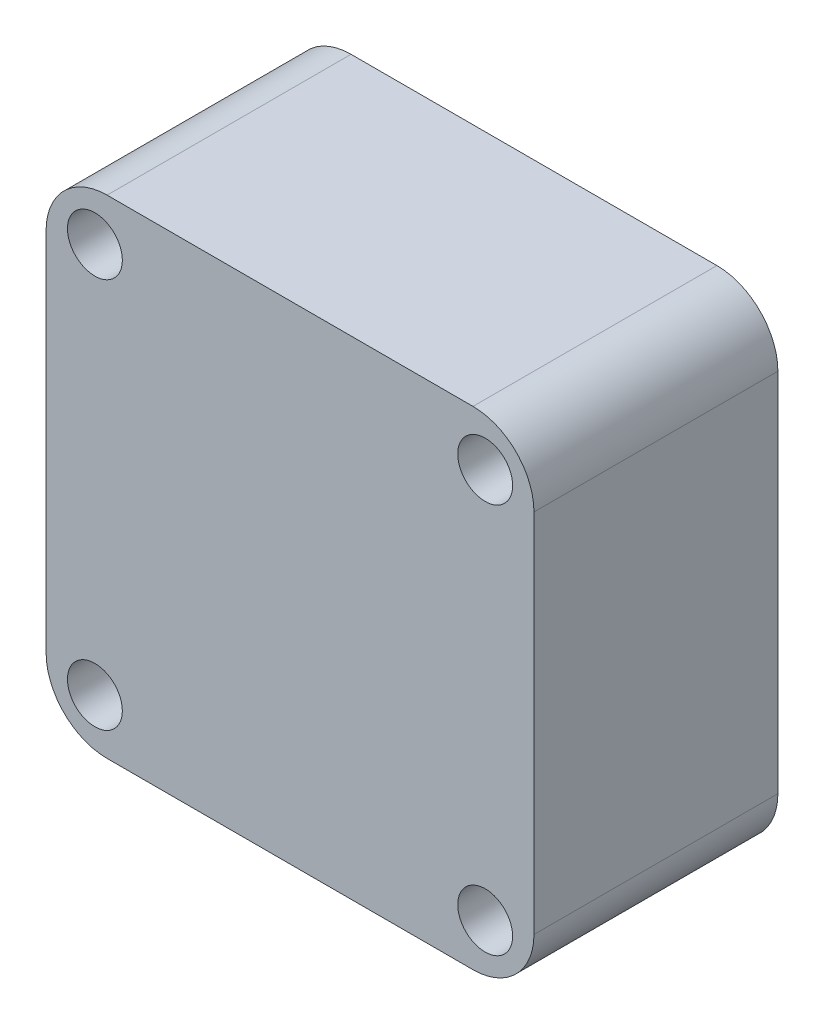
ISO-10303-21;
HEADER;
FILE_DESCRIPTION(('STEP AP214'),'2;1');
FILE_NAME('part.step','',(''),(''),'','','');
FILE_SCHEMA(('AUTOMOTIVE_DESIGN { 1 0 10303 214 1 1 1 1 }'));
ENDSEC;
DATA;
#1=APPLICATION_CONTEXT('core data for automotive mechanical design processes');
#2=APPLICATION_PROTOCOL_DEFINITION('international standard','automotive_design',2000,#1);
#3=PRODUCT_CONTEXT('',#1,'mechanical');
#4=PRODUCT('Part','Part','',(#3));
#5=PRODUCT_RELATED_PRODUCT_CATEGORY('part','',(#4));
#6=PRODUCT_DEFINITION_FORMATION('','',#4);
#7=PRODUCT_DEFINITION_CONTEXT('part definition',#1,'design');
#8=PRODUCT_DEFINITION('design','',#6,#7);
#9=PRODUCT_DEFINITION_SHAPE('','',#8);
#10=(LENGTH_UNIT() NAMED_UNIT(*) SI_UNIT(.MILLI.,.METRE.));
#11=(NAMED_UNIT(*) PLANE_ANGLE_UNIT() SI_UNIT($,.RADIAN.));
#12=(NAMED_UNIT(*) SI_UNIT($,.STERADIAN.) SOLID_ANGLE_UNIT());
#13=UNCERTAINTY_MEASURE_WITH_UNIT(LENGTH_MEASURE(1.E-05),#10,'distance_accuracy_value','');
#14=(GEOMETRIC_REPRESENTATION_CONTEXT(3) GLOBAL_UNCERTAINTY_ASSIGNED_CONTEXT((#13)) GLOBAL_UNIT_ASSIGNED_CONTEXT((#10,
#11,#12)) REPRESENTATION_CONTEXT('',''));
#15=CARTESIAN_POINT('',(0.,0.,0.));
#16=DIRECTION('',(0.,0.,1.));
#17=DIRECTION('',(1.,0.,0.));
#18=AXIS2_PLACEMENT_3D('',#15,#16,#17);
#19=CARTESIAN_POINT('',(0.,0.,20.));
#20=DIRECTION('',(0.,0.,1.));
#21=DIRECTION('',(1.,0.,0.));
#22=AXIS2_PLACEMENT_3D('',#19,#20,#21);
#23=PLANE('',#22);
#24=CARTESIAN_POINT('',(16.,-16.,20.));
#25=DIRECTION('',(0.,0.,1.));
#26=DIRECTION('',(1.,0.,0.));
#27=AXIS2_PLACEMENT_3D('',#24,#25,#26);
#28=CIRCLE('',#27,2.25);
#29=CARTESIAN_POINT('',(18.25,-16.,20.));
#30=VERTEX_POINT('',#29);
#31=EDGE_CURVE('E180',#30,#30,#28,.T.);
#32=ORIENTED_EDGE('',*,*,#31,.F.);
#33=EDGE_LOOP('',(#32));
#34=FACE_BOUND('',#33,.T.);
#35=CARTESIAN_POINT('',(-16.,16.,20.));
#36=DIRECTION('',(0.,0.,1.));
#37=DIRECTION('',(1.,0.,0.));
#38=AXIS2_PLACEMENT_3D('',#35,#36,#37);
#39=CIRCLE('',#38,2.25);
#40=CARTESIAN_POINT('',(-13.75,16.,20.));
#41=VERTEX_POINT('',#40);
#42=EDGE_CURVE('E164',#41,#41,#39,.T.);
#43=ORIENTED_EDGE('',*,*,#42,.F.);
#44=EDGE_LOOP('',(#43));
#45=FACE_BOUND('',#44,.T.);
#46=DIRECTION('',(0.,-1.,0.));
#47=VECTOR('',#46,1.);
#48=CARTESIAN_POINT('',(-20.,20.,20.));
#49=LINE('',#48,#47);
#50=CARTESIAN_POINT('',(-20.,15.,20.));
#51=VERTEX_POINT('',#50);
#52=CARTESIAN_POINT('',(-20.,-15.,20.));
#53=VERTEX_POINT('',#52);
#54=EDGE_CURVE('E122',#51,#53,#49,.T.);
#55=ORIENTED_EDGE('',*,*,#54,.T.);
#56=CARTESIAN_POINT('',(-15.,-15.,20.));
#57=DIRECTION('',(0.,0.,1.));
#58=DIRECTION('',(1.,0.,0.));
#59=AXIS2_PLACEMENT_3D('',#56,#57,#58);
#60=CIRCLE('',#59,5.);
#61=CARTESIAN_POINT('',(-15.,-20.,20.));
#62=VERTEX_POINT('',#61);
#63=EDGE_CURVE('E157',#53,#62,#60,.T.);
#64=ORIENTED_EDGE('',*,*,#63,.T.);
#65=DIRECTION('',(1.,0.,0.));
#66=VECTOR('',#65,1.);
#67=CARTESIAN_POINT('',(-20.,-20.,20.));
#68=LINE('',#67,#66);
#69=CARTESIAN_POINT('',(15.,-20.,20.));
#70=VERTEX_POINT('',#69);
#71=EDGE_CURVE('E123',#62,#70,#68,.T.);
#72=ORIENTED_EDGE('',*,*,#71,.T.);
#73=CARTESIAN_POINT('',(15.,-15.,20.));
#74=DIRECTION('',(0.,0.,1.));
#75=DIRECTION('',(1.,0.,0.));
#76=AXIS2_PLACEMENT_3D('',#73,#74,#75);
#77=CIRCLE('',#76,5.);
#78=CARTESIAN_POINT('',(20.,-15.,20.));
#79=VERTEX_POINT('',#78);
#80=EDGE_CURVE('E58',#70,#79,#77,.T.);
#81=ORIENTED_EDGE('',*,*,#80,.T.);
#82=DIRECTION('',(0.,1.,0.));
#83=VECTOR('',#82,1.);
#84=CARTESIAN_POINT('',(20.,20.,20.));
#85=LINE('',#84,#83);
#86=CARTESIAN_POINT('',(20.,15.,20.));
#87=VERTEX_POINT('',#86);
#88=EDGE_CURVE('E133',#79,#87,#85,.T.);
#89=ORIENTED_EDGE('',*,*,#88,.T.);
#90=CARTESIAN_POINT('',(15.,15.,20.));
#91=DIRECTION('',(0.,0.,1.));
#92=DIRECTION('',(1.,0.,0.));
#93=AXIS2_PLACEMENT_3D('',#90,#91,#92);
#94=CIRCLE('',#93,5.);
#95=CARTESIAN_POINT('',(15.,20.,20.));
#96=VERTEX_POINT('',#95);
#97=EDGE_CURVE('E154',#87,#96,#94,.T.);
#98=ORIENTED_EDGE('',*,*,#97,.T.);
#99=DIRECTION('',(-1.,0.,0.));
#100=VECTOR('',#99,1.);
#101=CARTESIAN_POINT('',(-20.,20.,20.));
#102=LINE('',#101,#100);
#103=CARTESIAN_POINT('',(-15.,20.,20.));
#104=VERTEX_POINT('',#103);
#105=EDGE_CURVE('E171',#96,#104,#102,.T.);
#106=ORIENTED_EDGE('',*,*,#105,.T.);
#107=CARTESIAN_POINT('',(-15.,15.,20.));
#108=DIRECTION('',(0.,0.,1.));
#109=DIRECTION('',(1.,0.,0.));
#110=AXIS2_PLACEMENT_3D('',#107,#108,#109);
#111=CIRCLE('',#110,5.);
#112=EDGE_CURVE('E140',#104,#51,#111,.T.);
#113=ORIENTED_EDGE('',*,*,#112,.T.);
#114=EDGE_LOOP('',(#55,#64,#72,#81,#89,#98,#106,#113));
#115=FACE_BOUND('',#114,.T.);
#116=CARTESIAN_POINT('',(16.,16.,20.));
#117=DIRECTION('',(0.,0.,1.));
#118=DIRECTION('',(1.,0.,0.));
#119=AXIS2_PLACEMENT_3D('',#116,#117,#118);
#120=CIRCLE('',#119,2.25);
#121=CARTESIAN_POINT('',(18.25,16.,20.));
#122=VERTEX_POINT('',#121);
#123=EDGE_CURVE('E175',#122,#122,#120,.T.);
#124=ORIENTED_EDGE('',*,*,#123,.F.);
#125=EDGE_LOOP('',(#124));
#126=FACE_BOUND('',#125,.T.);
#127=CARTESIAN_POINT('',(-16.,-16.,20.));
#128=DIRECTION('',(0.,0.,1.));
#129=DIRECTION('',(1.,0.,0.));
#130=AXIS2_PLACEMENT_3D('',#127,#128,#129);
#131=CIRCLE('',#130,2.25);
#132=CARTESIAN_POINT('',(-13.75,-16.,20.));
#133=VERTEX_POINT('',#132);
#134=EDGE_CURVE('E186',#133,#133,#131,.T.);
#135=ORIENTED_EDGE('',*,*,#134,.F.);
#136=EDGE_LOOP('',(#135));
#137=FACE_BOUND('',#136,.T.);
#138=ADVANCED_FACE('F36',(#34,#45,#115,#126,#137),#23,.T.);
#139=CARTESIAN_POINT('',(0.,0.,0.));
#140=DIRECTION('',(0.,0.,1.));
#141=DIRECTION('',(1.,0.,0.));
#142=AXIS2_PLACEMENT_3D('',#139,#140,#141);
#143=PLANE('',#142);
#144=CARTESIAN_POINT('',(16.,-16.,0.));
#145=DIRECTION('',(0.,0.,1.));
#146=DIRECTION('',(1.,0.,0.));
#147=AXIS2_PLACEMENT_3D('',#144,#145,#146);
#148=CIRCLE('',#147,2.25);
#149=CARTESIAN_POINT('',(18.25,-16.,0.));
#150=VERTEX_POINT('',#149);
#151=EDGE_CURVE('E183',#150,#150,#148,.T.);
#152=ORIENTED_EDGE('',*,*,#151,.T.);
#153=EDGE_LOOP('',(#152));
#154=FACE_BOUND('',#153,.T.);
#155=CARTESIAN_POINT('',(-16.,16.,0.));
#156=DIRECTION('',(0.,0.,1.));
#157=DIRECTION('',(1.,0.,0.));
#158=AXIS2_PLACEMENT_3D('',#155,#156,#157);
#159=CIRCLE('',#158,2.25);
#160=CARTESIAN_POINT('',(-13.75,16.,0.));
#161=VERTEX_POINT('',#160);
#162=EDGE_CURVE('E166',#161,#161,#159,.T.);
#163=ORIENTED_EDGE('',*,*,#162,.T.);
#164=EDGE_LOOP('',(#163));
#165=FACE_BOUND('',#164,.T.);
#166=DIRECTION('',(1.,0.,0.));
#167=VECTOR('',#166,1.);
#168=CARTESIAN_POINT('',(-20.,-20.,0.));
#169=LINE('',#168,#167);
#170=CARTESIAN_POINT('',(-15.,-20.,0.));
#171=VERTEX_POINT('',#170);
#172=CARTESIAN_POINT('',(15.,-20.,0.));
#173=VERTEX_POINT('',#172);
#174=EDGE_CURVE('E129',#171,#173,#169,.T.);
#175=ORIENTED_EDGE('',*,*,#174,.F.);
#176=CARTESIAN_POINT('',(-15.,-15.,0.));
#177=DIRECTION('',(0.,0.,1.));
#178=DIRECTION('',(1.,0.,0.));
#179=AXIS2_PLACEMENT_3D('',#176,#177,#178);
#180=CIRCLE('',#179,5.);
#181=CARTESIAN_POINT('',(-20.,-15.,0.));
#182=VERTEX_POINT('',#181);
#183=EDGE_CURVE('E128',#171,#182,#180,.F.);
#184=ORIENTED_EDGE('',*,*,#183,.T.);
#185=DIRECTION('',(0.,-1.,0.));
#186=VECTOR('',#185,1.);
#187=CARTESIAN_POINT('',(-20.,20.,0.));
#188=LINE('',#187,#186);
#189=CARTESIAN_POINT('',(-20.,15.,0.));
#190=VERTEX_POINT('',#189);
#191=EDGE_CURVE('E119',#190,#182,#188,.T.);
#192=ORIENTED_EDGE('',*,*,#191,.F.);
#193=CARTESIAN_POINT('',(-15.,15.,0.));
#194=DIRECTION('',(0.,0.,1.));
#195=DIRECTION('',(1.,0.,0.));
#196=AXIS2_PLACEMENT_3D('',#193,#194,#195);
#197=CIRCLE('',#196,5.);
#198=CARTESIAN_POINT('',(-15.,20.,0.));
#199=VERTEX_POINT('',#198);
#200=EDGE_CURVE('E104',#190,#199,#197,.F.);
#201=ORIENTED_EDGE('',*,*,#200,.T.);
#202=DIRECTION('',(-1.,0.,0.));
#203=VECTOR('',#202,1.);
#204=CARTESIAN_POINT('',(-20.,20.,0.));
#205=LINE('',#204,#203);
#206=CARTESIAN_POINT('',(15.,20.,0.));
#207=VERTEX_POINT('',#206);
#208=EDGE_CURVE('E130',#207,#199,#205,.T.);
#209=ORIENTED_EDGE('',*,*,#208,.F.);
#210=CARTESIAN_POINT('',(15.,15.,0.));
#211=DIRECTION('',(0.,0.,1.));
#212=DIRECTION('',(1.,0.,0.));
#213=AXIS2_PLACEMENT_3D('',#210,#211,#212);
#214=CIRCLE('',#213,5.);
#215=CARTESIAN_POINT('',(20.,15.,0.));
#216=VERTEX_POINT('',#215);
#217=EDGE_CURVE('E147',#207,#216,#214,.F.);
#218=ORIENTED_EDGE('',*,*,#217,.T.);
#219=DIRECTION('',(0.,1.,0.));
#220=VECTOR('',#219,1.);
#221=CARTESIAN_POINT('',(20.,20.,0.));
#222=LINE('',#221,#220);
#223=CARTESIAN_POINT('',(20.,-15.,0.));
#224=VERTEX_POINT('',#223);
#225=EDGE_CURVE('E135',#224,#216,#222,.T.);
#226=ORIENTED_EDGE('',*,*,#225,.F.);
#227=CARTESIAN_POINT('',(15.,-15.,0.));
#228=DIRECTION('',(0.,0.,1.));
#229=DIRECTION('',(1.,0.,0.));
#230=AXIS2_PLACEMENT_3D('',#227,#228,#229);
#231=CIRCLE('',#230,5.);
#232=EDGE_CURVE('E149',#224,#173,#231,.F.);
#233=ORIENTED_EDGE('',*,*,#232,.T.);
#234=EDGE_LOOP('',(#175,#184,#192,#201,#209,#218,#226,#233));
#235=FACE_BOUND('',#234,.T.);
#236=CARTESIAN_POINT('',(16.,16.,0.));
#237=DIRECTION('',(0.,0.,1.));
#238=DIRECTION('',(1.,0.,0.));
#239=AXIS2_PLACEMENT_3D('',#236,#237,#238);
#240=CIRCLE('',#239,2.25);
#241=CARTESIAN_POINT('',(18.25,16.,0.));
#242=VERTEX_POINT('',#241);
#243=EDGE_CURVE('E177',#242,#242,#240,.T.);
#244=ORIENTED_EDGE('',*,*,#243,.T.);
#245=EDGE_LOOP('',(#244));
#246=FACE_BOUND('',#245,.T.);
#247=CARTESIAN_POINT('',(-16.,-16.,0.));
#248=DIRECTION('',(0.,0.,1.));
#249=DIRECTION('',(1.,0.,0.));
#250=AXIS2_PLACEMENT_3D('',#247,#248,#249);
#251=CIRCLE('',#250,2.25);
#252=CARTESIAN_POINT('',(-13.75,-16.,0.));
#253=VERTEX_POINT('',#252);
#254=EDGE_CURVE('E189',#253,#253,#251,.T.);
#255=ORIENTED_EDGE('',*,*,#254,.T.);
#256=EDGE_LOOP('',(#255));
#257=FACE_BOUND('',#256,.T.);
#258=ADVANCED_FACE('F126',(#154,#165,#235,#246,#257),#143,.F.);
#259=CARTESIAN_POINT('',(20.,20.,20.));
#260=DIRECTION('',(-1.,0.,0.));
#261=DIRECTION('',(0.,0.,1.));
#262=AXIS2_PLACEMENT_3D('',#259,#260,#261);
#263=PLANE('',#262);
#264=ORIENTED_EDGE('',*,*,#88,.F.);
#265=DIRECTION('',(0.,0.,-1.));
#266=VECTOR('',#265,1.);
#267=CARTESIAN_POINT('',(20.,-15.,20.));
#268=LINE('',#267,#266);
#269=EDGE_CURVE('E44',#79,#224,#268,.T.);
#270=ORIENTED_EDGE('',*,*,#269,.T.);
#271=ORIENTED_EDGE('',*,*,#225,.T.);
#272=DIRECTION('',(0.,0.,-1.));
#273=VECTOR('',#272,1.);
#274=CARTESIAN_POINT('',(20.,15.,20.));
#275=LINE('',#274,#273);
#276=EDGE_CURVE('E51',#216,#87,#275,.F.);
#277=ORIENTED_EDGE('',*,*,#276,.T.);
#278=EDGE_LOOP('',(#264,#270,#271,#277));
#279=FACE_BOUND('',#278,.T.);
#280=ADVANCED_FACE('F162',(#279),#263,.F.);
#281=CARTESIAN_POINT('',(-20.,20.,20.));
#282=DIRECTION('',(0.,-1.,0.));
#283=DIRECTION('',(1.,0.,0.));
#284=AXIS2_PLACEMENT_3D('',#281,#282,#283);
#285=PLANE('',#284);
#286=ORIENTED_EDGE('',*,*,#105,.F.);
#287=DIRECTION('',(0.,0.,-1.));
#288=VECTOR('',#287,1.);
#289=CARTESIAN_POINT('',(15.,20.,20.));
#290=LINE('',#289,#288);
#291=EDGE_CURVE('E11',#96,#207,#290,.T.);
#292=ORIENTED_EDGE('',*,*,#291,.T.);
#293=ORIENTED_EDGE('',*,*,#208,.T.);
#294=DIRECTION('',(0.,0.,-1.));
#295=VECTOR('',#294,1.);
#296=CARTESIAN_POINT('',(-15.,20.,20.));
#297=LINE('',#296,#295);
#298=EDGE_CURVE('E110',#199,#104,#297,.F.);
#299=ORIENTED_EDGE('',*,*,#298,.T.);
#300=EDGE_LOOP('',(#286,#292,#293,#299));
#301=FACE_BOUND('',#300,.T.);
#302=ADVANCED_FACE('F218',(#301),#285,.F.);
#303=CARTESIAN_POINT('',(-20.,20.,20.));
#304=DIRECTION('',(1.,0.,0.));
#305=DIRECTION('',(0.,0.,-1.));
#306=AXIS2_PLACEMENT_3D('',#303,#304,#305);
#307=PLANE('',#306);
#308=ORIENTED_EDGE('',*,*,#191,.T.);
#309=DIRECTION('',(0.,0.,-1.));
#310=VECTOR('',#309,1.);
#311=CARTESIAN_POINT('',(-20.,-15.,20.));
#312=LINE('',#311,#310);
#313=EDGE_CURVE('E152',#182,#53,#312,.F.);
#314=ORIENTED_EDGE('',*,*,#313,.T.);
#315=ORIENTED_EDGE('',*,*,#54,.F.);
#316=DIRECTION('',(0.,0.,-1.));
#317=VECTOR('',#316,1.);
#318=CARTESIAN_POINT('',(-20.,15.,20.));
#319=LINE('',#318,#317);
#320=EDGE_CURVE('E108',#51,#190,#319,.T.);
#321=ORIENTED_EDGE('',*,*,#320,.T.);
#322=EDGE_LOOP('',(#308,#314,#315,#321));
#323=FACE_BOUND('',#322,.T.);
#324=ADVANCED_FACE('F118',(#323),#307,.F.);
#325=CARTESIAN_POINT('',(-20.,-20.,20.));
#326=DIRECTION('',(0.,1.,0.));
#327=DIRECTION('',(0.,0.,1.));
#328=AXIS2_PLACEMENT_3D('',#325,#326,#327);
#329=PLANE('',#328);
#330=ORIENTED_EDGE('',*,*,#71,.F.);
#331=DIRECTION('',(0.,0.,-1.));
#332=VECTOR('',#331,1.);
#333=CARTESIAN_POINT('',(-15.,-20.,20.));
#334=LINE('',#333,#332);
#335=EDGE_CURVE('E144',#62,#171,#334,.T.);
#336=ORIENTED_EDGE('',*,*,#335,.T.);
#337=ORIENTED_EDGE('',*,*,#174,.T.);
#338=DIRECTION('',(0.,0.,-1.));
#339=VECTOR('',#338,1.);
#340=CARTESIAN_POINT('',(15.,-20.,20.));
#341=LINE('',#340,#339);
#342=EDGE_CURVE('E142',#173,#70,#341,.F.);
#343=ORIENTED_EDGE('',*,*,#342,.T.);
#344=EDGE_LOOP('',(#330,#336,#337,#343));
#345=FACE_BOUND('',#344,.T.);
#346=ADVANCED_FACE('F212',(#345),#329,.F.);
#347=CARTESIAN_POINT('',(-16.,16.,20.));
#348=DIRECTION('',(0.,0.,-1.));
#349=DIRECTION('',(-1.,0.,0.));
#350=AXIS2_PLACEMENT_3D('',#347,#348,#349);
#351=CYLINDRICAL_SURFACE('',#350,2.25);
#352=ORIENTED_EDGE('',*,*,#42,.T.);
#353=EDGE_LOOP('',(#352));
#354=FACE_BOUND('',#353,.T.);
#355=ORIENTED_EDGE('',*,*,#162,.F.);
#356=EDGE_LOOP('',(#355));
#357=FACE_BOUND('',#356,.T.);
#358=ADVANCED_FACE('F209',(#354,#357),#351,.F.);
#359=CARTESIAN_POINT('',(16.,16.,20.));
#360=DIRECTION('',(0.,0.,-1.));
#361=DIRECTION('',(-1.,0.,0.));
#362=AXIS2_PLACEMENT_3D('',#359,#360,#361);
#363=CYLINDRICAL_SURFACE('',#362,2.25);
#364=ORIENTED_EDGE('',*,*,#123,.T.);
#365=EDGE_LOOP('',(#364));
#366=FACE_BOUND('',#365,.T.);
#367=ORIENTED_EDGE('',*,*,#243,.F.);
#368=EDGE_LOOP('',(#367));
#369=FACE_BOUND('',#368,.T.);
#370=ADVANCED_FACE('F245',(#366,#369),#363,.F.);
#371=CARTESIAN_POINT('',(16.,-16.,20.));
#372=DIRECTION('',(0.,0.,-1.));
#373=DIRECTION('',(-1.,0.,0.));
#374=AXIS2_PLACEMENT_3D('',#371,#372,#373);
#375=CYLINDRICAL_SURFACE('',#374,2.25);
#376=ORIENTED_EDGE('',*,*,#31,.T.);
#377=EDGE_LOOP('',(#376));
#378=FACE_BOUND('',#377,.T.);
#379=ORIENTED_EDGE('',*,*,#151,.F.);
#380=EDGE_LOOP('',(#379));
#381=FACE_BOUND('',#380,.T.);
#382=ADVANCED_FACE('F248',(#378,#381),#375,.F.);
#383=CARTESIAN_POINT('',(-16.,-16.,20.));
#384=DIRECTION('',(0.,0.,-1.));
#385=DIRECTION('',(-1.,0.,0.));
#386=AXIS2_PLACEMENT_3D('',#383,#384,#385);
#387=CYLINDRICAL_SURFACE('',#386,2.25);
#388=ORIENTED_EDGE('',*,*,#134,.T.);
#389=EDGE_LOOP('',(#388));
#390=FACE_BOUND('',#389,.T.);
#391=ORIENTED_EDGE('',*,*,#254,.F.);
#392=EDGE_LOOP('',(#391));
#393=FACE_BOUND('',#392,.T.);
#394=ADVANCED_FACE('F195',(#390,#393),#387,.F.);
#395=CARTESIAN_POINT('',(-15.,15.,20.));
#396=DIRECTION('',(0.,0.,-1.));
#397=DIRECTION('',(-1.,0.,0.));
#398=AXIS2_PLACEMENT_3D('',#395,#396,#397);
#399=CYLINDRICAL_SURFACE('',#398,5.);
#400=ORIENTED_EDGE('',*,*,#112,.F.);
#401=ORIENTED_EDGE('',*,*,#298,.F.);
#402=ORIENTED_EDGE('',*,*,#200,.F.);
#403=ORIENTED_EDGE('',*,*,#320,.F.);
#404=EDGE_LOOP('',(#400,#401,#402,#403));
#405=FACE_BOUND('',#404,.T.);
#406=ADVANCED_FACE('F107',(#405),#399,.T.);
#407=CARTESIAN_POINT('',(-15.,-15.,20.));
#408=DIRECTION('',(0.,0.,-1.));
#409=DIRECTION('',(-1.,0.,0.));
#410=AXIS2_PLACEMENT_3D('',#407,#408,#409);
#411=CYLINDRICAL_SURFACE('',#410,5.);
#412=ORIENTED_EDGE('',*,*,#63,.F.);
#413=ORIENTED_EDGE('',*,*,#313,.F.);
#414=ORIENTED_EDGE('',*,*,#183,.F.);
#415=ORIENTED_EDGE('',*,*,#335,.F.);
#416=EDGE_LOOP('',(#412,#413,#414,#415));
#417=FACE_BOUND('',#416,.T.);
#418=ADVANCED_FACE('F226',(#417),#411,.T.);
#419=CARTESIAN_POINT('',(15.,-15.,20.));
#420=DIRECTION('',(0.,0.,-1.));
#421=DIRECTION('',(-1.,0.,0.));
#422=AXIS2_PLACEMENT_3D('',#419,#420,#421);
#423=CYLINDRICAL_SURFACE('',#422,5.);
#424=ORIENTED_EDGE('',*,*,#80,.F.);
#425=ORIENTED_EDGE('',*,*,#342,.F.);
#426=ORIENTED_EDGE('',*,*,#232,.F.);
#427=ORIENTED_EDGE('',*,*,#269,.F.);
#428=EDGE_LOOP('',(#424,#425,#426,#427));
#429=FACE_BOUND('',#428,.T.);
#430=ADVANCED_FACE('F228',(#429),#423,.T.);
#431=CARTESIAN_POINT('',(15.,15.,20.));
#432=DIRECTION('',(0.,0.,-1.));
#433=DIRECTION('',(-1.,0.,0.));
#434=AXIS2_PLACEMENT_3D('',#431,#432,#433);
#435=CYLINDRICAL_SURFACE('',#434,5.);
#436=ORIENTED_EDGE('',*,*,#97,.F.);
#437=ORIENTED_EDGE('',*,*,#276,.F.);
#438=ORIENTED_EDGE('',*,*,#217,.F.);
#439=ORIENTED_EDGE('',*,*,#291,.F.);
#440=EDGE_LOOP('',(#436,#437,#438,#439));
#441=FACE_BOUND('',#440,.T.);
#442=ADVANCED_FACE('F38',(#441),#435,.T.);
#443=CLOSED_SHELL('',(#138,#258,#280,#302,#324,#346,#358,#370,#382,#394,#406,#418,#430,#442));
#444=MANIFOLD_SOLID_BREP('B2',#443);
#445=ADVANCED_BREP_SHAPE_REPRESENTATION('',(#18,#444),#14);
#446=SHAPE_DEFINITION_REPRESENTATION(#9,#445);
ENDSEC;
END-ISO-10303-21;
